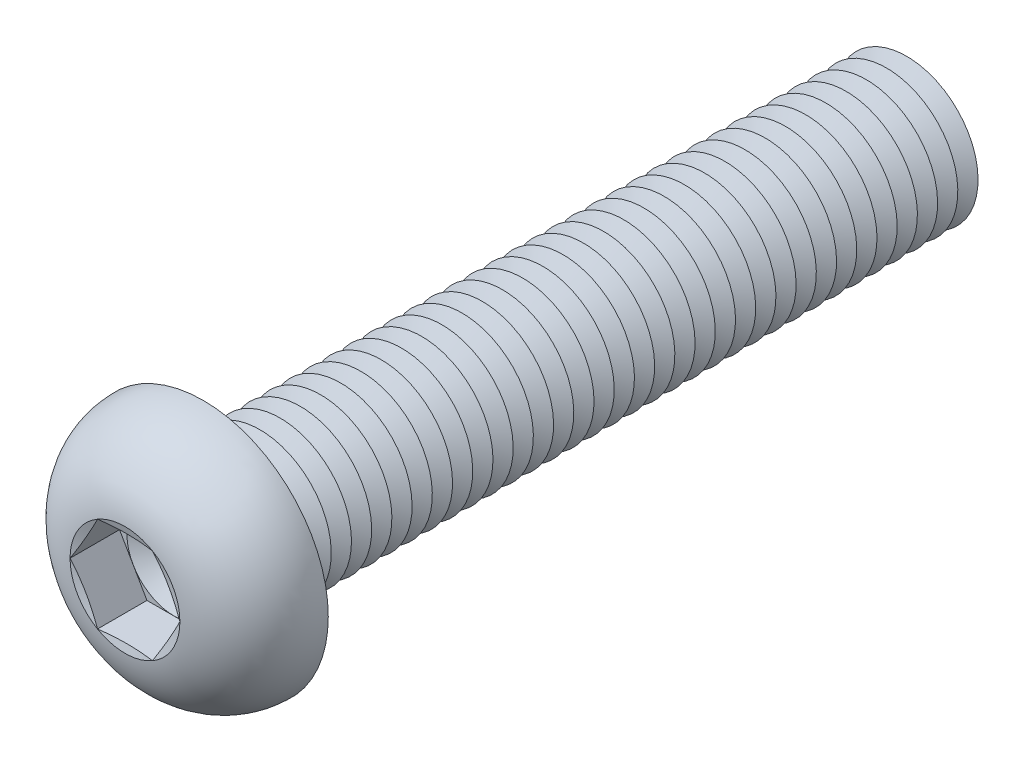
from build123d import *

# Parameters (mm, degrees)
FILLET1_R          = 0.85
LPATTERN1_COUNT    = 35
LPATTERN1_PITCH    = 1.7
CUT_EXTRUDE1_DEPTH = 4.16


with BuildPart() as part:
    # Sketch1 → Revolve1 (revolve)
    with BuildSketch(Plane(origin=(0, 0, 0), x_dir=(0, 0, -1), z_dir=(1, 0, 0))):
        with BuildLine():
            Line((0, 6), (0, 10.5))
            ThreePointArc((0, 10.5), (-4.420082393, 8.816378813), (-6.6, 4.6188))
            Line((-6.6, 4.6188), (-5.981198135, 2.3094))
            Line((-5.981198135, 2.3094), (-6.6, 2.3094))
            Line((-6.6, 2.3094), (-6.6, 0))
            Line((-6.6, 0), (60, 0))
            Line((60, 0), (60, 6))
            Line((60, 6), (0, 6))
        make_face()
    revolve(axis=Axis((0, 0, -60), (0, 0, 1)))

    # Fillet1
    fillet1_edges = [part.edges().sort_by_distance(p)[0] for p in [
        (0, -6, 0),
    ]]
    fillet(fillet1_edges, radius=FILLET1_R)

    # Sketch2 → Cut-Revolve1 (revolve, cut)
    with BuildSketch(Plane(origin=(0, 0, 0), x_dir=(0, 0, -1), z_dir=(1, 0, 0))):
        Polygon((59.15, 6), (60.85, 6), (60, 4.527756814), align=None)
    cut_revolve1 = revolve(axis=Axis((0, 0, -60), (0, 0, -1)), mode=Mode.SUBTRACT)

    # LPattern1: Cut-Revolve1 ×35
    with Locations(*[(0, 0, i * LPATTERN1_PITCH) for i in range(1, LPATTERN1_COUNT)]):
        add(cut_revolve1, mode=Mode.SUBTRACT)

    # Sketch3 → Cut-Extrude1 (cut)
    with BuildSketch(Plane.XY.offset(6.6)):
        Polygon((2.3094, 3.999998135), (-2.3094, 3.999998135), (-4.6188, 0), (-2.3094, -3.999998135), (2.3094, -3.999998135), (4.6188, 0), align=None)
    extrude(amount=-CUT_EXTRUDE1_DEPTH, mode=Mode.SUBTRACT)

    # Cut-Extrude2 cone 1 section (on through the dimple's axis) → Cut-Extrude2 (revolve, cut)
    with BuildSketch(Plane(origin=(0, 0, 2.44), x_dir=(0, -1, 0), z_dir=(1, 0, 0))):
        Polygon((0, 0), (3.999998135, 0), (0, 2.3094), align=None)
    revolve(axis=Axis((0, 0, 2.44), (0, 0, -1)), mode=Mode.SUBTRACT)


solid = part.part
